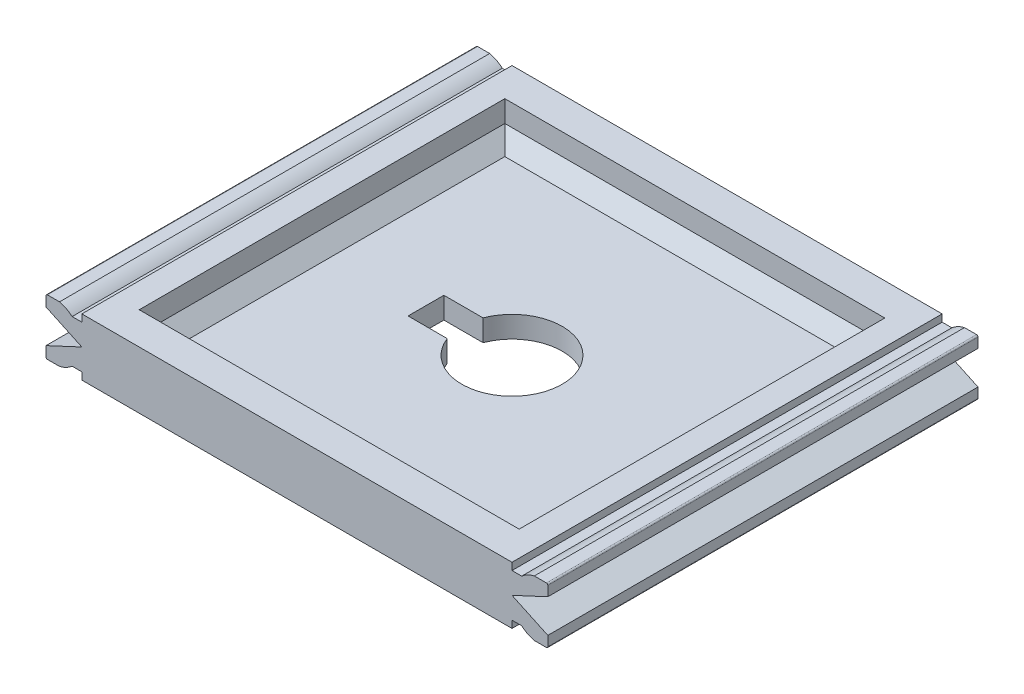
ISO-10303-21;
HEADER;
FILE_DESCRIPTION(('STEP AP214'),'2;1');
FILE_NAME('part.step','',(''),(''),'','','');
FILE_SCHEMA(('AUTOMOTIVE_DESIGN { 1 0 10303 214 1 1 1 1 }'));
ENDSEC;
DATA;
#1=APPLICATION_CONTEXT('core data for automotive mechanical design processes');
#2=APPLICATION_PROTOCOL_DEFINITION('international standard','automotive_design',2000,#1);
#3=PRODUCT_CONTEXT('',#1,'mechanical');
#4=PRODUCT('Part','Part','',(#3));
#5=PRODUCT_RELATED_PRODUCT_CATEGORY('part','',(#4));
#6=PRODUCT_DEFINITION_FORMATION('','',#4);
#7=PRODUCT_DEFINITION_CONTEXT('part definition',#1,'design');
#8=PRODUCT_DEFINITION('design','',#6,#7);
#9=PRODUCT_DEFINITION_SHAPE('','',#8);
#10=(LENGTH_UNIT() NAMED_UNIT(*) SI_UNIT(.MILLI.,.METRE.));
#11=(NAMED_UNIT(*) PLANE_ANGLE_UNIT() SI_UNIT($,.RADIAN.));
#12=(NAMED_UNIT(*) SI_UNIT($,.STERADIAN.) SOLID_ANGLE_UNIT());
#13=UNCERTAINTY_MEASURE_WITH_UNIT(LENGTH_MEASURE(1.E-05),#10,'distance_accuracy_value','');
#14=(GEOMETRIC_REPRESENTATION_CONTEXT(3) GLOBAL_UNCERTAINTY_ASSIGNED_CONTEXT((#13)) GLOBAL_UNIT_ASSIGNED_CONTEXT((#10,
#11,#12)) REPRESENTATION_CONTEXT('',''));
#15=CARTESIAN_POINT('',(0.,0.,0.));
#16=DIRECTION('',(0.,0.,1.));
#17=DIRECTION('',(1.,0.,0.));
#18=AXIS2_PLACEMENT_3D('',#15,#16,#17);
#19=CARTESIAN_POINT('',(-15.,-2.,-15.));
#20=DIRECTION('',(-1.,0.,0.));
#21=DIRECTION('',(0.,0.,1.));
#22=AXIS2_PLACEMENT_3D('',#19,#20,#21);
#23=PLANE('',#22);
#24=DIRECTION('',(0.,1.,0.));
#25=VECTOR('',#24,1.);
#26=CARTESIAN_POINT('',(-15.,-2.,15.));
#27=LINE('',#26,#25);
#28=CARTESIAN_POINT('',(-15.,-2.,15.));
#29=VERTEX_POINT('',#28);
#30=CARTESIAN_POINT('',(-15.,-1.5,15.));
#31=VERTEX_POINT('',#30);
#32=EDGE_CURVE('E570',#29,#31,#27,.T.);
#33=ORIENTED_EDGE('',*,*,#32,.T.);
#34=DIRECTION('',(0.,0.,1.));
#35=VECTOR('',#34,1.);
#36=CARTESIAN_POINT('',(-15.,-1.5,-15.));
#37=LINE('',#36,#35);
#38=CARTESIAN_POINT('',(-15.,-1.5,-15.));
#39=VERTEX_POINT('',#38);
#40=EDGE_CURVE('E355',#39,#31,#37,.T.);
#41=ORIENTED_EDGE('',*,*,#40,.F.);
#42=DIRECTION('',(0.,1.,0.));
#43=VECTOR('',#42,1.);
#44=CARTESIAN_POINT('',(-15.,-2.,-15.));
#45=LINE('',#44,#43);
#46=CARTESIAN_POINT('',(-15.,-2.,-15.));
#47=VERTEX_POINT('',#46);
#48=EDGE_CURVE('E589',#47,#39,#45,.T.);
#49=ORIENTED_EDGE('',*,*,#48,.F.);
#50=DIRECTION('',(0.,0.,1.));
#51=VECTOR('',#50,1.);
#52=CARTESIAN_POINT('',(-15.,-2.,-15.));
#53=LINE('',#52,#51);
#54=EDGE_CURVE('E601',#47,#29,#53,.T.);
#55=ORIENTED_EDGE('',*,*,#54,.T.);
#56=EDGE_LOOP('',(#33,#41,#49,#55));
#57=FACE_BOUND('',#56,.T.);
#58=ADVANCED_FACE('F36',(#57),#23,.T.);
#59=CARTESIAN_POINT('',(-15.,1.5,-15.));
#60=VERTEX_POINT('',#59);
#61=CARTESIAN_POINT('',(-15.,2.,-15.));
#62=VERTEX_POINT('',#61);
#63=EDGE_CURVE('E588',#60,#62,#45,.T.);
#64=ORIENTED_EDGE('',*,*,#63,.F.);
#65=DIRECTION('',(0.,0.,1.));
#66=VECTOR('',#65,1.);
#67=CARTESIAN_POINT('',(-15.,1.5,-15.));
#68=LINE('',#67,#66);
#69=CARTESIAN_POINT('',(-15.,1.5,15.));
#70=VERTEX_POINT('',#69);
#71=EDGE_CURVE('E386',#60,#70,#68,.T.);
#72=ORIENTED_EDGE('',*,*,#71,.T.);
#73=CARTESIAN_POINT('',(-15.,2.,15.));
#74=VERTEX_POINT('',#73);
#75=EDGE_CURVE('E575',#70,#74,#27,.T.);
#76=ORIENTED_EDGE('',*,*,#75,.T.);
#77=DIRECTION('',(0.,0.,1.));
#78=VECTOR('',#77,1.);
#79=CARTESIAN_POINT('',(-15.,2.,-15.));
#80=LINE('',#79,#78);
#81=EDGE_CURVE('E691',#62,#74,#80,.T.);
#82=ORIENTED_EDGE('',*,*,#81,.F.);
#83=EDGE_LOOP('',(#64,#72,#76,#82));
#84=FACE_BOUND('',#83,.T.);
#85=ADVANCED_FACE('F790',(#84),#23,.T.);
#86=CARTESIAN_POINT('',(15.,-2.,-15.));
#87=DIRECTION('',(1.,0.,0.));
#88=DIRECTION('',(0.,0.,-1.));
#89=AXIS2_PLACEMENT_3D('',#86,#87,#88);
#90=PLANE('',#89);
#91=DIRECTION('',(0.,0.,1.));
#92=VECTOR('',#91,1.);
#93=CARTESIAN_POINT('',(15.,-1.5,-15.));
#94=LINE('',#93,#92);
#95=CARTESIAN_POINT('',(15.,-1.5,-15.));
#96=VERTEX_POINT('',#95);
#97=CARTESIAN_POINT('',(15.,-1.5,15.));
#98=VERTEX_POINT('',#97);
#99=EDGE_CURVE('E517',#96,#98,#94,.T.);
#100=ORIENTED_EDGE('',*,*,#99,.T.);
#101=DIRECTION('',(0.,1.,0.));
#102=VECTOR('',#101,1.);
#103=CARTESIAN_POINT('',(15.,-2.,15.));
#104=LINE('',#103,#102);
#105=CARTESIAN_POINT('',(15.,-2.,15.));
#106=VERTEX_POINT('',#105);
#107=EDGE_CURVE('E716',#106,#98,#104,.T.);
#108=ORIENTED_EDGE('',*,*,#107,.F.);
#109=DIRECTION('',(0.,0.,-1.));
#110=VECTOR('',#109,1.);
#111=CARTESIAN_POINT('',(15.,-2.,-15.));
#112=LINE('',#111,#110);
#113=CARTESIAN_POINT('',(15.,-2.,-15.));
#114=VERTEX_POINT('',#113);
#115=EDGE_CURVE('E592',#106,#114,#112,.T.);
#116=ORIENTED_EDGE('',*,*,#115,.T.);
#117=DIRECTION('',(0.,1.,0.));
#118=VECTOR('',#117,1.);
#119=CARTESIAN_POINT('',(15.,-2.,-15.));
#120=LINE('',#119,#118);
#121=EDGE_CURVE('E610',#114,#96,#120,.T.);
#122=ORIENTED_EDGE('',*,*,#121,.T.);
#123=EDGE_LOOP('',(#100,#108,#116,#122));
#124=FACE_BOUND('',#123,.T.);
#125=ADVANCED_FACE('F709',(#124),#90,.T.);
#126=CARTESIAN_POINT('',(15.,-2.,-15.));
#127=DIRECTION('',(0.,0.,-1.));
#128=DIRECTION('',(-1.,0.,0.));
#129=AXIS2_PLACEMENT_3D('',#126,#127,#128);
#130=PLANE('',#129);
#131=DIRECTION('',(0.,-1.,0.));
#132=VECTOR('',#131,1.);
#133=CARTESIAN_POINT('',(17.5,0.,-15.));
#134=LINE('',#133,#132);
#135=CARTESIAN_POINT('',(17.5,-1.1657691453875,-15.));
#136=VERTEX_POINT('',#135);
#137=CARTESIAN_POINT('',(17.5,-1.85,-15.));
#138=VERTEX_POINT('',#137);
#139=EDGE_CURVE('E502',#136,#138,#134,.T.);
#140=ORIENTED_EDGE('',*,*,#139,.T.);
#141=CARTESIAN_POINT('',(17.4,-1.85,-15.));
#142=DIRECTION('',(0.,0.,-1.));
#143=DIRECTION('',(-1.,0.,0.));
#144=AXIS2_PLACEMENT_3D('',#141,#142,#143);
#145=CIRCLE('',#144,0.1);
#146=CARTESIAN_POINT('',(17.4,-1.95,-15.));
#147=VERTEX_POINT('',#146);
#148=EDGE_CURVE('E433',#138,#147,#145,.T.);
#149=ORIENTED_EDGE('',*,*,#148,.T.);
#150=DIRECTION('',(-1.,0.,0.));
#151=VECTOR('',#150,1.);
#152=CARTESIAN_POINT('',(0.,-1.94999999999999,-15.));
#153=LINE('',#152,#151);
#154=CARTESIAN_POINT('',(16.5555902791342,-1.95,-15.));
#155=VERTEX_POINT('',#154);
#156=EDGE_CURVE('E500',#147,#155,#153,.T.);
#157=ORIENTED_EDGE('',*,*,#156,.T.);
#158=CARTESIAN_POINT('',(17.,0.,-15.));
#159=DIRECTION('',(0.,0.,-1.));
#160=DIRECTION('',(1.,0.,0.));
#161=AXIS2_PLACEMENT_3D('',#158,#159,#160);
#162=CIRCLE('',#161,2.);
#163=CARTESIAN_POINT('',(15.6771243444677,-1.5,-15.));
#164=VERTEX_POINT('',#163);
#165=EDGE_CURVE('E508',#155,#164,#162,.T.);
#166=ORIENTED_EDGE('',*,*,#165,.T.);
#167=DIRECTION('',(1.,0.,0.));
#168=VECTOR('',#167,1.);
#169=CARTESIAN_POINT('',(0.,-1.50000000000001,-15.));
#170=LINE('',#169,#168);
#171=EDGE_CURVE('E505',#96,#164,#170,.T.);
#172=ORIENTED_EDGE('',*,*,#171,.F.);
#173=ORIENTED_EDGE('',*,*,#121,.F.);
#174=DIRECTION('',(-1.,0.,0.));
#175=VECTOR('',#174,1.);
#176=CARTESIAN_POINT('',(15.,-2.,-15.));
#177=LINE('',#176,#175);
#178=EDGE_CURVE('E700',#114,#47,#177,.T.);
#179=ORIENTED_EDGE('',*,*,#178,.T.);
#180=ORIENTED_EDGE('',*,*,#48,.T.);
#181=DIRECTION('',(-1.,0.,0.));
#182=VECTOR('',#181,1.);
#183=CARTESIAN_POINT('',(0.,-1.50000000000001,-15.));
#184=LINE('',#183,#182);
#185=CARTESIAN_POINT('',(-15.6771243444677,-1.5,-15.));
#186=VERTEX_POINT('',#185);
#187=EDGE_CURVE('E345',#39,#186,#184,.T.);
#188=ORIENTED_EDGE('',*,*,#187,.T.);
#189=CARTESIAN_POINT('',(-17.,0.,-15.));
#190=DIRECTION('',(0.,0.,1.));
#191=DIRECTION('',(-1.,0.,0.));
#192=AXIS2_PLACEMENT_3D('',#189,#190,#191);
#193=CIRCLE('',#192,2.);
#194=CARTESIAN_POINT('',(-16.5555902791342,-1.95,-15.));
#195=VERTEX_POINT('',#194);
#196=EDGE_CURVE('E342',#195,#186,#193,.T.);
#197=ORIENTED_EDGE('',*,*,#196,.F.);
#198=DIRECTION('',(1.,0.,0.));
#199=VECTOR('',#198,1.);
#200=CARTESIAN_POINT('',(0.,-1.94999999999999,-15.));
#201=LINE('',#200,#199);
#202=CARTESIAN_POINT('',(-17.4,-1.95,-15.));
#203=VERTEX_POINT('',#202);
#204=EDGE_CURVE('E340',#203,#195,#201,.T.);
#205=ORIENTED_EDGE('',*,*,#204,.F.);
#206=CARTESIAN_POINT('',(-17.4,-1.85,-15.));
#207=DIRECTION('',(0.,0.,-1.));
#208=DIRECTION('',(-1.,0.,0.));
#209=AXIS2_PLACEMENT_3D('',#206,#207,#208);
#210=CIRCLE('',#209,0.1);
#211=CARTESIAN_POINT('',(-17.5,-1.85,-15.));
#212=VERTEX_POINT('',#211);
#213=EDGE_CURVE('E429',#203,#212,#210,.T.);
#214=ORIENTED_EDGE('',*,*,#213,.T.);
#215=DIRECTION('',(0.,-1.,0.));
#216=VECTOR('',#215,1.);
#217=CARTESIAN_POINT('',(-17.5,0.,-15.));
#218=LINE('',#217,#216);
#219=CARTESIAN_POINT('',(-17.5,-1.1657691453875,-15.));
#220=VERTEX_POINT('',#219);
#221=EDGE_CURVE('E348',#220,#212,#218,.T.);
#222=ORIENTED_EDGE('',*,*,#221,.F.);
#223=DIRECTION('',(-0.906307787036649,-0.422618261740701,0.));
#224=VECTOR('',#223,1.);
#225=CARTESIAN_POINT('',(-2.67909292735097,5.74533332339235,-15.));
#226=LINE('',#225,#224);
#227=CARTESIAN_POINT('',(-15.,0.,-15.));
#228=VERTEX_POINT('',#227);
#229=EDGE_CURVE('E347',#228,#220,#226,.T.);
#230=ORIENTED_EDGE('',*,*,#229,.F.);
#231=DIRECTION('',(-0.906307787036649,0.422618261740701,0.));
#232=VECTOR('',#231,1.);
#233=CARTESIAN_POINT('',(-2.67909292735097,-5.74533332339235,-15.));
#234=LINE('',#233,#232);
#235=CARTESIAN_POINT('',(-17.5,1.1657691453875,-15.));
#236=VERTEX_POINT('',#235);
#237=EDGE_CURVE('E375',#228,#236,#234,.T.);
#238=ORIENTED_EDGE('',*,*,#237,.T.);
#239=DIRECTION('',(0.,1.,0.));
#240=VECTOR('',#239,1.);
#241=CARTESIAN_POINT('',(-17.5,0.,-15.));
#242=LINE('',#241,#240);
#243=CARTESIAN_POINT('',(-17.5,1.85,-15.));
#244=VERTEX_POINT('',#243);
#245=EDGE_CURVE('E372',#236,#244,#242,.T.);
#246=ORIENTED_EDGE('',*,*,#245,.T.);
#247=CARTESIAN_POINT('',(-17.4,1.85,-15.));
#248=DIRECTION('',(0.,0.,-1.));
#249=DIRECTION('',(-1.,0.,0.));
#250=AXIS2_PLACEMENT_3D('',#247,#248,#249);
#251=CIRCLE('',#250,0.1);
#252=CARTESIAN_POINT('',(-17.4,1.95,-15.));
#253=VERTEX_POINT('',#252);
#254=EDGE_CURVE('E427',#244,#253,#251,.T.);
#255=ORIENTED_EDGE('',*,*,#254,.T.);
#256=DIRECTION('',(1.,0.,0.));
#257=VECTOR('',#256,1.);
#258=CARTESIAN_POINT('',(0.,1.94999999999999,-15.));
#259=LINE('',#258,#257);
#260=CARTESIAN_POINT('',(-16.5555902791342,1.95,-15.));
#261=VERTEX_POINT('',#260);
#262=EDGE_CURVE('E369',#253,#261,#259,.T.);
#263=ORIENTED_EDGE('',*,*,#262,.T.);
#264=CARTESIAN_POINT('',(-17.,0.,-15.));
#265=DIRECTION('',(0.,0.,-1.));
#266=DIRECTION('',(-1.,0.,0.));
#267=AXIS2_PLACEMENT_3D('',#264,#265,#266);
#268=CIRCLE('',#267,2.);
#269=CARTESIAN_POINT('',(-15.6771243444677,1.5,-15.));
#270=VERTEX_POINT('',#269);
#271=EDGE_CURVE('E376',#261,#270,#268,.T.);
#272=ORIENTED_EDGE('',*,*,#271,.T.);
#273=DIRECTION('',(-1.,0.,0.));
#274=VECTOR('',#273,1.);
#275=CARTESIAN_POINT('',(0.,1.50000000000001,-15.));
#276=LINE('',#275,#274);
#277=EDGE_CURVE('E379',#60,#270,#276,.T.);
#278=ORIENTED_EDGE('',*,*,#277,.F.);
#279=ORIENTED_EDGE('',*,*,#63,.T.);
#280=DIRECTION('',(-1.,0.,0.));
#281=VECTOR('',#280,1.);
#282=CARTESIAN_POINT('',(15.,2.,-15.));
#283=LINE('',#282,#281);
#284=CARTESIAN_POINT('',(15.,2.,-15.));
#285=VERTEX_POINT('',#284);
#286=EDGE_CURVE('E665',#285,#62,#283,.T.);
#287=ORIENTED_EDGE('',*,*,#286,.F.);
#288=CARTESIAN_POINT('',(15.,1.5,-15.));
#289=VERTEX_POINT('',#288);
#290=EDGE_CURVE('E607',#289,#285,#120,.T.);
#291=ORIENTED_EDGE('',*,*,#290,.F.);
#292=DIRECTION('',(1.,0.,0.));
#293=VECTOR('',#292,1.);
#294=CARTESIAN_POINT('',(0.,1.50000000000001,-15.));
#295=LINE('',#294,#293);
#296=CARTESIAN_POINT('',(15.6771243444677,1.5,-15.));
#297=VERTEX_POINT('',#296);
#298=EDGE_CURVE('E534',#289,#297,#295,.T.);
#299=ORIENTED_EDGE('',*,*,#298,.T.);
#300=CARTESIAN_POINT('',(17.,0.,-15.));
#301=DIRECTION('',(0.,0.,1.));
#302=DIRECTION('',(1.,0.,0.));
#303=AXIS2_PLACEMENT_3D('',#300,#301,#302);
#304=CIRCLE('',#303,2.);
#305=CARTESIAN_POINT('',(16.5555902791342,1.95,-15.));
#306=VERTEX_POINT('',#305);
#307=EDGE_CURVE('E531',#306,#297,#304,.T.);
#308=ORIENTED_EDGE('',*,*,#307,.F.);
#309=DIRECTION('',(-1.,0.,0.));
#310=VECTOR('',#309,1.);
#311=CARTESIAN_POINT('',(0.,1.94999999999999,-15.));
#312=LINE('',#311,#310);
#313=CARTESIAN_POINT('',(17.4,1.95,-15.));
#314=VERTEX_POINT('',#313);
#315=EDGE_CURVE('E528',#314,#306,#312,.T.);
#316=ORIENTED_EDGE('',*,*,#315,.F.);
#317=CARTESIAN_POINT('',(17.4,1.85,-15.));
#318=DIRECTION('',(0.,0.,-1.));
#319=DIRECTION('',(-1.,0.,0.));
#320=AXIS2_PLACEMENT_3D('',#317,#318,#319);
#321=CIRCLE('',#320,0.1);
#322=CARTESIAN_POINT('',(17.5,1.85,-15.));
#323=VERTEX_POINT('',#322);
#324=EDGE_CURVE('E431',#314,#323,#321,.T.);
#325=ORIENTED_EDGE('',*,*,#324,.T.);
#326=DIRECTION('',(0.,1.,0.));
#327=VECTOR('',#326,1.);
#328=CARTESIAN_POINT('',(17.5,0.,-15.));
#329=LINE('',#328,#327);
#330=CARTESIAN_POINT('',(17.5,1.1657691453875,-15.));
#331=VERTEX_POINT('',#330);
#332=EDGE_CURVE('E535',#331,#323,#329,.T.);
#333=ORIENTED_EDGE('',*,*,#332,.F.);
#334=DIRECTION('',(0.906307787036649,0.422618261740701,0.));
#335=VECTOR('',#334,1.);
#336=CARTESIAN_POINT('',(2.67909292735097,-5.74533332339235,-15.));
#337=LINE('',#336,#335);
#338=CARTESIAN_POINT('',(15.,0.,-15.));
#339=VERTEX_POINT('',#338);
#340=EDGE_CURVE('E539',#339,#331,#337,.T.);
#341=ORIENTED_EDGE('',*,*,#340,.F.);
#342=DIRECTION('',(0.906307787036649,-0.422618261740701,0.));
#343=VECTOR('',#342,1.);
#344=CARTESIAN_POINT('',(2.67909292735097,5.74533332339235,-15.));
#345=LINE('',#344,#343);
#346=EDGE_CURVE('E504',#339,#136,#345,.T.);
#347=ORIENTED_EDGE('',*,*,#346,.T.);
#348=EDGE_LOOP('',(#140,#149,#157,#166,#172,#173,#179,#180,#188,#197,#205,#214,#222,#230,#238,
#246,#255,#263,#272,#278,#279,#287,#291,#299,#308,#316,#325,#333,#341,#347));
#349=FACE_BOUND('',#348,.T.);
#350=ADVANCED_FACE('F467',(#349),#130,.T.);
#351=DIRECTION('',(0.,0.,1.));
#352=VECTOR('',#351,1.);
#353=CARTESIAN_POINT('',(15.,1.5,-15.));
#354=LINE('',#353,#352);
#355=CARTESIAN_POINT('',(15.,1.5,15.));
#356=VERTEX_POINT('',#355);
#357=EDGE_CURVE('E552',#289,#356,#354,.T.);
#358=ORIENTED_EDGE('',*,*,#357,.F.);
#359=ORIENTED_EDGE('',*,*,#290,.T.);
#360=DIRECTION('',(0.,0.,-1.));
#361=VECTOR('',#360,1.);
#362=CARTESIAN_POINT('',(15.,2.,-15.));
#363=LINE('',#362,#361);
#364=CARTESIAN_POINT('',(15.,2.,15.));
#365=VERTEX_POINT('',#364);
#366=EDGE_CURVE('E697',#365,#285,#363,.T.);
#367=ORIENTED_EDGE('',*,*,#366,.F.);
#368=EDGE_CURVE('E574',#356,#365,#104,.T.);
#369=ORIENTED_EDGE('',*,*,#368,.F.);
#370=EDGE_LOOP('',(#358,#359,#367,#369));
#371=FACE_BOUND('',#370,.T.);
#372=ADVANCED_FACE('F779',(#371),#90,.T.);
#373=CARTESIAN_POINT('',(15.,-2.,15.));
#374=DIRECTION('',(0.,0.,1.));
#375=DIRECTION('',(1.,0.,0.));
#376=AXIS2_PLACEMENT_3D('',#373,#374,#375);
#377=PLANE('',#376);
#378=DIRECTION('',(-1.,0.,0.));
#379=VECTOR('',#378,1.);
#380=CARTESIAN_POINT('',(0.,-1.94999999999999,15.));
#381=LINE('',#380,#379);
#382=CARTESIAN_POINT('',(17.4,-1.95,15.));
#383=VERTEX_POINT('',#382);
#384=CARTESIAN_POINT('',(16.5555902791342,-1.95,15.));
#385=VERTEX_POINT('',#384);
#386=EDGE_CURVE('E383',#383,#385,#381,.T.);
#387=ORIENTED_EDGE('',*,*,#386,.F.);
#388=CARTESIAN_POINT('',(17.4,-1.85,15.));
#389=DIRECTION('',(0.,0.,1.));
#390=DIRECTION('',(1.,0.,0.));
#391=AXIS2_PLACEMENT_3D('',#388,#389,#390);
#392=CIRCLE('',#391,0.1);
#393=CARTESIAN_POINT('',(17.5,-1.85,15.));
#394=VERTEX_POINT('',#393);
#395=EDGE_CURVE('E423',#383,#394,#392,.T.);
#396=ORIENTED_EDGE('',*,*,#395,.T.);
#397=DIRECTION('',(0.,-1.,0.));
#398=VECTOR('',#397,1.);
#399=CARTESIAN_POINT('',(17.5,0.,15.));
#400=LINE('',#399,#398);
#401=CARTESIAN_POINT('',(17.5,-1.1657691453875,15.));
#402=VERTEX_POINT('',#401);
#403=EDGE_CURVE('E490',#402,#394,#400,.T.);
#404=ORIENTED_EDGE('',*,*,#403,.F.);
#405=DIRECTION('',(0.906307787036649,-0.422618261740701,0.));
#406=VECTOR('',#405,1.);
#407=CARTESIAN_POINT('',(2.67909292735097,5.74533332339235,15.));
#408=LINE('',#407,#406);
#409=CARTESIAN_POINT('',(15.,0.,15.));
#410=VERTEX_POINT('',#409);
#411=EDGE_CURVE('E493',#410,#402,#408,.T.);
#412=ORIENTED_EDGE('',*,*,#411,.F.);
#413=DIRECTION('',(0.906307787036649,0.422618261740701,0.));
#414=VECTOR('',#413,1.);
#415=CARTESIAN_POINT('',(2.67909292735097,-5.74533332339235,15.));
#416=LINE('',#415,#414);
#417=CARTESIAN_POINT('',(17.5,1.1657691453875,15.));
#418=VERTEX_POINT('',#417);
#419=EDGE_CURVE('E529',#410,#418,#416,.T.);
#420=ORIENTED_EDGE('',*,*,#419,.T.);
#421=DIRECTION('',(0.,1.,0.));
#422=VECTOR('',#421,1.);
#423=CARTESIAN_POINT('',(17.5,0.,15.));
#424=LINE('',#423,#422);
#425=CARTESIAN_POINT('',(17.5,1.85,15.));
#426=VERTEX_POINT('',#425);
#427=EDGE_CURVE('E525',#418,#426,#424,.T.);
#428=ORIENTED_EDGE('',*,*,#427,.T.);
#429=CARTESIAN_POINT('',(17.4,1.85,15.));
#430=DIRECTION('',(0.,0.,1.));
#431=DIRECTION('',(1.,0.,0.));
#432=AXIS2_PLACEMENT_3D('',#429,#430,#431);
#433=CIRCLE('',#432,0.1);
#434=CARTESIAN_POINT('',(17.4,1.95,15.));
#435=VERTEX_POINT('',#434);
#436=EDGE_CURVE('E421',#426,#435,#433,.T.);
#437=ORIENTED_EDGE('',*,*,#436,.T.);
#438=DIRECTION('',(-1.,0.,0.));
#439=VECTOR('',#438,1.);
#440=CARTESIAN_POINT('',(0.,1.94999999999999,15.));
#441=LINE('',#440,#439);
#442=CARTESIAN_POINT('',(16.5555902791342,1.95,15.));
#443=VERTEX_POINT('',#442);
#444=EDGE_CURVE('E514',#435,#443,#441,.T.);
#445=ORIENTED_EDGE('',*,*,#444,.T.);
#446=CARTESIAN_POINT('',(17.,0.,15.));
#447=DIRECTION('',(0.,0.,1.));
#448=DIRECTION('',(1.,0.,0.));
#449=AXIS2_PLACEMENT_3D('',#446,#447,#448);
#450=CIRCLE('',#449,2.);
#451=CARTESIAN_POINT('',(15.6771243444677,1.5,15.));
#452=VERTEX_POINT('',#451);
#453=EDGE_CURVE('E521',#443,#452,#450,.T.);
#454=ORIENTED_EDGE('',*,*,#453,.T.);
#455=DIRECTION('',(1.,0.,0.));
#456=VECTOR('',#455,1.);
#457=CARTESIAN_POINT('',(0.,1.50000000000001,15.));
#458=LINE('',#457,#456);
#459=EDGE_CURVE('E524',#356,#452,#458,.T.);
#460=ORIENTED_EDGE('',*,*,#459,.F.);
#461=ORIENTED_EDGE('',*,*,#368,.T.);
#462=DIRECTION('',(1.,0.,0.));
#463=VECTOR('',#462,1.);
#464=CARTESIAN_POINT('',(15.,2.,15.));
#465=LINE('',#464,#463);
#466=EDGE_CURVE('E694',#74,#365,#465,.T.);
#467=ORIENTED_EDGE('',*,*,#466,.F.);
#468=ORIENTED_EDGE('',*,*,#75,.F.);
#469=DIRECTION('',(-1.,0.,0.));
#470=VECTOR('',#469,1.);
#471=CARTESIAN_POINT('',(0.,1.50000000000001,15.));
#472=LINE('',#471,#470);
#473=CARTESIAN_POINT('',(-15.6771243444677,1.5,15.));
#474=VERTEX_POINT('',#473);
#475=EDGE_CURVE('E370',#70,#474,#472,.T.);
#476=ORIENTED_EDGE('',*,*,#475,.T.);
#477=CARTESIAN_POINT('',(-17.,0.,15.));
#478=DIRECTION('',(0.,0.,-1.));
#479=DIRECTION('',(-1.,0.,0.));
#480=AXIS2_PLACEMENT_3D('',#477,#478,#479);
#481=CIRCLE('',#480,2.);
#482=CARTESIAN_POINT('',(-16.5555902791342,1.95,15.));
#483=VERTEX_POINT('',#482);
#484=EDGE_CURVE('E366',#483,#474,#481,.T.);
#485=ORIENTED_EDGE('',*,*,#484,.F.);
#486=DIRECTION('',(1.,0.,0.));
#487=VECTOR('',#486,1.);
#488=CARTESIAN_POINT('',(0.,1.94999999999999,15.));
#489=LINE('',#488,#487);
#490=CARTESIAN_POINT('',(-17.4,1.95,15.));
#491=VERTEX_POINT('',#490);
#492=EDGE_CURVE('E354',#491,#483,#489,.T.);
#493=ORIENTED_EDGE('',*,*,#492,.F.);
#494=CARTESIAN_POINT('',(-17.4,1.85,15.));
#495=DIRECTION('',(0.,0.,1.));
#496=DIRECTION('',(1.,0.,0.));
#497=AXIS2_PLACEMENT_3D('',#494,#495,#496);
#498=CIRCLE('',#497,0.1);
#499=CARTESIAN_POINT('',(-17.5,1.85,15.));
#500=VERTEX_POINT('',#499);
#501=EDGE_CURVE('E416',#491,#500,#498,.T.);
#502=ORIENTED_EDGE('',*,*,#501,.T.);
#503=DIRECTION('',(0.,1.,0.));
#504=VECTOR('',#503,1.);
#505=CARTESIAN_POINT('',(-17.5,0.,15.));
#506=LINE('',#505,#504);
#507=CARTESIAN_POINT('',(-17.5,1.1657691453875,15.));
#508=VERTEX_POINT('',#507);
#509=EDGE_CURVE('E362',#508,#500,#506,.T.);
#510=ORIENTED_EDGE('',*,*,#509,.F.);
#511=DIRECTION('',(-0.906307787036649,0.422618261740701,0.));
#512=VECTOR('',#511,1.);
#513=CARTESIAN_POINT('',(-2.67909292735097,-5.74533332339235,15.));
#514=LINE('',#513,#512);
#515=CARTESIAN_POINT('',(-15.,0.,15.));
#516=VERTEX_POINT('',#515);
#517=EDGE_CURVE('E365',#516,#508,#514,.T.);
#518=ORIENTED_EDGE('',*,*,#517,.F.);
#519=DIRECTION('',(-0.906307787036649,-0.422618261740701,0.));
#520=VECTOR('',#519,1.);
#521=CARTESIAN_POINT('',(-2.67909292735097,5.74533332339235,15.));
#522=LINE('',#521,#520);
#523=CARTESIAN_POINT('',(-17.5,-1.1657691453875,15.));
#524=VERTEX_POINT('',#523);
#525=EDGE_CURVE('E336',#516,#524,#522,.T.);
#526=ORIENTED_EDGE('',*,*,#525,.T.);
#527=DIRECTION('',(0.,-1.,0.));
#528=VECTOR('',#527,1.);
#529=CARTESIAN_POINT('',(-17.5,0.,15.));
#530=LINE('',#529,#528);
#531=CARTESIAN_POINT('',(-17.5,-1.85,15.));
#532=VERTEX_POINT('',#531);
#533=EDGE_CURVE('E337',#524,#532,#530,.T.);
#534=ORIENTED_EDGE('',*,*,#533,.T.);
#535=CARTESIAN_POINT('',(-17.4,-1.85,15.));
#536=DIRECTION('',(0.,0.,1.));
#537=DIRECTION('',(1.,0.,0.));
#538=AXIS2_PLACEMENT_3D('',#535,#536,#537);
#539=CIRCLE('',#538,0.1);
#540=CARTESIAN_POINT('',(-17.4,-1.95,15.));
#541=VERTEX_POINT('',#540);
#542=EDGE_CURVE('E419',#532,#541,#539,.T.);
#543=ORIENTED_EDGE('',*,*,#542,.T.);
#544=DIRECTION('',(1.,0.,0.));
#545=VECTOR('',#544,1.);
#546=CARTESIAN_POINT('',(0.,-1.94999999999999,15.));
#547=LINE('',#546,#545);
#548=CARTESIAN_POINT('',(-16.5555902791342,-1.95,15.));
#549=VERTEX_POINT('',#548);
#550=EDGE_CURVE('E306',#541,#549,#547,.T.);
#551=ORIENTED_EDGE('',*,*,#550,.T.);
#552=CARTESIAN_POINT('',(-17.,0.,15.));
#553=DIRECTION('',(0.,0.,1.));
#554=DIRECTION('',(-1.,0.,0.));
#555=AXIS2_PLACEMENT_3D('',#552,#553,#554);
#556=CIRCLE('',#555,2.);
#557=CARTESIAN_POINT('',(-15.6771243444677,-1.5,15.));
#558=VERTEX_POINT('',#557);
#559=EDGE_CURVE('E330',#549,#558,#556,.T.);
#560=ORIENTED_EDGE('',*,*,#559,.T.);
#561=DIRECTION('',(-1.,0.,0.));
#562=VECTOR('',#561,1.);
#563=CARTESIAN_POINT('',(0.,-1.50000000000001,15.));
#564=LINE('',#563,#562);
#565=EDGE_CURVE('E333',#31,#558,#564,.T.);
#566=ORIENTED_EDGE('',*,*,#565,.F.);
#567=ORIENTED_EDGE('',*,*,#32,.F.);
#568=DIRECTION('',(1.,0.,0.));
#569=VECTOR('',#568,1.);
#570=CARTESIAN_POINT('',(15.,-2.,15.));
#571=LINE('',#570,#569);
#572=EDGE_CURVE('E596',#29,#106,#571,.T.);
#573=ORIENTED_EDGE('',*,*,#572,.T.);
#574=ORIENTED_EDGE('',*,*,#107,.T.);
#575=DIRECTION('',(1.,0.,0.));
#576=VECTOR('',#575,1.);
#577=CARTESIAN_POINT('',(0.,-1.50000000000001,15.));
#578=LINE('',#577,#576);
#579=CARTESIAN_POINT('',(15.6771243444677,-1.5,15.));
#580=VERTEX_POINT('',#579);
#581=EDGE_CURVE('E494',#98,#580,#578,.T.);
#582=ORIENTED_EDGE('',*,*,#581,.T.);
#583=CARTESIAN_POINT('',(17.,0.,15.));
#584=DIRECTION('',(0.,0.,-1.));
#585=DIRECTION('',(1.,0.,0.));
#586=AXIS2_PLACEMENT_3D('',#583,#584,#585);
#587=CIRCLE('',#586,2.);
#588=EDGE_CURVE('E497',#385,#580,#587,.T.);
#589=ORIENTED_EDGE('',*,*,#588,.F.);
#590=EDGE_LOOP('',(#387,#396,#404,#412,#420,#428,#437,#445,#454,#460,#461,#467,#468,#476,#485,
#493,#502,#510,#518,#526,#534,#543,#551,#560,#566,#567,#573,#574,#582,#589));
#591=FACE_BOUND('',#590,.T.);
#592=ADVANCED_FACE('F456',(#591),#377,.T.);
#593=CARTESIAN_POINT('',(0.,-2.,0.));
#594=DIRECTION('',(0.,1.,0.));
#595=DIRECTION('',(0.,0.,1.));
#596=AXIS2_PLACEMENT_3D('',#593,#594,#595);
#597=PLANE('',#596);
#598=DIRECTION('',(1.,0.,0.));
#599=VECTOR('',#598,1.);
#600=CARTESIAN_POINT('',(-3.26917420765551,-2.,-1.25));
#601=LINE('',#600,#599);
#602=CARTESIAN_POINT('',(-6.,-2.,-1.25));
#603=VERTEX_POINT('',#602);
#604=CARTESIAN_POINT('',(-3.26917420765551,-2.,-1.25));
#605=VERTEX_POINT('',#604);
#606=EDGE_CURVE('E312',#603,#605,#601,.T.);
#607=ORIENTED_EDGE('',*,*,#606,.F.);
#608=DIRECTION('',(0.,0.,-1.));
#609=VECTOR('',#608,1.);
#610=CARTESIAN_POINT('',(-6.,-2.,-1.25));
#611=LINE('',#610,#609);
#612=CARTESIAN_POINT('',(-6.,-2.,1.25));
#613=VERTEX_POINT('',#612);
#614=EDGE_CURVE('E294',#613,#603,#611,.T.);
#615=ORIENTED_EDGE('',*,*,#614,.F.);
#616=DIRECTION('',(-1.,0.,0.));
#617=VECTOR('',#616,1.);
#618=CARTESIAN_POINT('',(-3.26917420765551,-2.,1.25));
#619=LINE('',#618,#617);
#620=CARTESIAN_POINT('',(-3.2691742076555,-2.,1.25));
#621=VERTEX_POINT('',#620);
#622=EDGE_CURVE('E303',#621,#613,#619,.T.);
#623=ORIENTED_EDGE('',*,*,#622,.F.);
#624=CARTESIAN_POINT('',(0.,-2.,0.));
#625=DIRECTION('',(0.,1.,0.));
#626=DIRECTION('',(0.,0.,1.));
#627=AXIS2_PLACEMENT_3D('',#624,#625,#626);
#628=CIRCLE('',#627,3.5);
#629=EDGE_CURVE('E51',#605,#621,#628,.F.);
#630=ORIENTED_EDGE('',*,*,#629,.F.);
#631=EDGE_LOOP('',(#607,#615,#623,#630));
#632=FACE_BOUND('',#631,.T.);
#633=ORIENTED_EDGE('',*,*,#178,.F.);
#634=ORIENTED_EDGE('',*,*,#115,.F.);
#635=ORIENTED_EDGE('',*,*,#572,.F.);
#636=ORIENTED_EDGE('',*,*,#54,.F.);
#637=EDGE_LOOP('',(#633,#634,#635,#636));
#638=FACE_BOUND('',#637,.T.);
#639=ADVANCED_FACE('F309',(#632,#638),#597,.F.);
#640=CARTESIAN_POINT('',(0.,2.,0.));
#641=DIRECTION('',(0.,1.,0.));
#642=DIRECTION('',(0.,0.,1.));
#643=AXIS2_PLACEMENT_3D('',#640,#641,#642);
#644=PLANE('',#643);
#645=DIRECTION('',(-1.,0.,0.));
#646=VECTOR('',#645,1.);
#647=CARTESIAN_POINT('',(13.25,2.,-12.75));
#648=LINE('',#647,#646);
#649=CARTESIAN_POINT('',(13.25,2.,-12.75));
#650=VERTEX_POINT('',#649);
#651=CARTESIAN_POINT('',(-13.25,2.,-12.75));
#652=VERTEX_POINT('',#651);
#653=EDGE_CURVE('E615',#650,#652,#648,.T.);
#654=ORIENTED_EDGE('',*,*,#653,.F.);
#655=DIRECTION('',(0.,0.,-1.));
#656=VECTOR('',#655,1.);
#657=CARTESIAN_POINT('',(13.25,2.,-12.75));
#658=LINE('',#657,#656);
#659=CARTESIAN_POINT('',(13.25,2.,12.75));
#660=VERTEX_POINT('',#659);
#661=EDGE_CURVE('E663',#660,#650,#658,.T.);
#662=ORIENTED_EDGE('',*,*,#661,.F.);
#663=DIRECTION('',(1.,0.,0.));
#664=VECTOR('',#663,1.);
#665=CARTESIAN_POINT('',(13.25,2.,12.75));
#666=LINE('',#665,#664);
#667=CARTESIAN_POINT('',(-13.25,2.,12.75));
#668=VERTEX_POINT('',#667);
#669=EDGE_CURVE('E1194',#668,#660,#666,.T.);
#670=ORIENTED_EDGE('',*,*,#669,.F.);
#671=DIRECTION('',(0.,0.,1.));
#672=VECTOR('',#671,1.);
#673=CARTESIAN_POINT('',(-13.25,2.,-12.75));
#674=LINE('',#673,#672);
#675=EDGE_CURVE('E683',#652,#668,#674,.T.);
#676=ORIENTED_EDGE('',*,*,#675,.F.);
#677=EDGE_LOOP('',(#654,#662,#670,#676));
#678=FACE_BOUND('',#677,.T.);
#679=ORIENTED_EDGE('',*,*,#286,.T.);
#680=ORIENTED_EDGE('',*,*,#81,.T.);
#681=ORIENTED_EDGE('',*,*,#466,.T.);
#682=ORIENTED_EDGE('',*,*,#366,.T.);
#683=EDGE_LOOP('',(#679,#680,#681,#682));
#684=FACE_BOUND('',#683,.T.);
#685=ADVANCED_FACE('F778',(#678,#684),#644,.T.);
#686=CARTESIAN_POINT('',(13.25,-0.5,-12.75));
#687=DIRECTION('',(0.,0.,-1.));
#688=DIRECTION('',(-1.,0.,0.));
#689=AXIS2_PLACEMENT_3D('',#686,#687,#688);
#690=PLANE('',#689);
#691=DIRECTION('',(0.,1.,0.));
#692=VECTOR('',#691,1.);
#693=CARTESIAN_POINT('',(-13.25,-0.5,-12.75));
#694=LINE('',#693,#692);
#695=CARTESIAN_POINT('',(-13.25,0.500000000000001,-12.75));
#696=VERTEX_POINT('',#695);
#697=EDGE_CURVE('E657',#696,#652,#694,.T.);
#698=ORIENTED_EDGE('',*,*,#697,.F.);
#699=DIRECTION('',(1.,0.,0.));
#700=VECTOR('',#699,1.);
#701=CARTESIAN_POINT('',(13.25,0.500000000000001,-12.75));
#702=LINE('',#701,#700);
#703=CARTESIAN_POINT('',(13.25,0.500000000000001,-12.75));
#704=VERTEX_POINT('',#703);
#705=EDGE_CURVE('E417',#696,#704,#702,.T.);
#706=ORIENTED_EDGE('',*,*,#705,.T.);
#707=DIRECTION('',(0.,1.,0.));
#708=VECTOR('',#707,1.);
#709=CARTESIAN_POINT('',(13.25,-0.5,-12.75));
#710=LINE('',#709,#708);
#711=EDGE_CURVE('E655',#704,#650,#710,.T.);
#712=ORIENTED_EDGE('',*,*,#711,.T.);
#713=ORIENTED_EDGE('',*,*,#653,.T.);
#714=EDGE_LOOP('',(#698,#706,#712,#713));
#715=FACE_BOUND('',#714,.T.);
#716=ADVANCED_FACE('F653',(#715),#690,.F.);
#717=CARTESIAN_POINT('',(13.25,-0.5,-12.75));
#718=DIRECTION('',(1.,0.,0.));
#719=DIRECTION('',(0.,0.,-1.));
#720=AXIS2_PLACEMENT_3D('',#717,#718,#719);
#721=PLANE('',#720);
#722=ORIENTED_EDGE('',*,*,#711,.F.);
#723=DIRECTION('',(0.,0.,1.));
#724=VECTOR('',#723,1.);
#725=CARTESIAN_POINT('',(13.25,0.500000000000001,-12.75));
#726=LINE('',#725,#724);
#727=CARTESIAN_POINT('',(13.25,0.500000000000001,12.75));
#728=VERTEX_POINT('',#727);
#729=EDGE_CURVE('E627',#704,#728,#726,.T.);
#730=ORIENTED_EDGE('',*,*,#729,.T.);
#731=DIRECTION('',(0.,1.,0.));
#732=VECTOR('',#731,1.);
#733=CARTESIAN_POINT('',(13.25,-0.5,12.75));
#734=LINE('',#733,#732);
#735=EDGE_CURVE('E666',#728,#660,#734,.T.);
#736=ORIENTED_EDGE('',*,*,#735,.T.);
#737=ORIENTED_EDGE('',*,*,#661,.T.);
#738=EDGE_LOOP('',(#722,#730,#736,#737));
#739=FACE_BOUND('',#738,.T.);
#740=ADVANCED_FACE('F660',(#739),#721,.F.);
#741=CARTESIAN_POINT('',(13.25,-0.5,12.75));
#742=DIRECTION('',(0.,0.,1.));
#743=DIRECTION('',(1.,0.,0.));
#744=AXIS2_PLACEMENT_3D('',#741,#742,#743);
#745=PLANE('',#744);
#746=ORIENTED_EDGE('',*,*,#735,.F.);
#747=DIRECTION('',(-1.,0.,0.));
#748=VECTOR('',#747,1.);
#749=CARTESIAN_POINT('',(13.25,0.500000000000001,12.75));
#750=LINE('',#749,#748);
#751=CARTESIAN_POINT('',(-13.25,0.500000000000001,12.75));
#752=VERTEX_POINT('',#751);
#753=EDGE_CURVE('E625',#728,#752,#750,.T.);
#754=ORIENTED_EDGE('',*,*,#753,.T.);
#755=DIRECTION('',(0.,1.,0.));
#756=VECTOR('',#755,1.);
#757=CARTESIAN_POINT('',(-13.25,-0.5,12.75));
#758=LINE('',#757,#756);
#759=EDGE_CURVE('E678',#752,#668,#758,.T.);
#760=ORIENTED_EDGE('',*,*,#759,.T.);
#761=ORIENTED_EDGE('',*,*,#669,.T.);
#762=EDGE_LOOP('',(#746,#754,#760,#761));
#763=FACE_BOUND('',#762,.T.);
#764=ADVANCED_FACE('F676',(#763),#745,.F.);
#765=CARTESIAN_POINT('',(-13.25,-0.5,-12.75));
#766=DIRECTION('',(-1.,0.,0.));
#767=DIRECTION('',(0.,0.,1.));
#768=AXIS2_PLACEMENT_3D('',#765,#766,#767);
#769=PLANE('',#768);
#770=ORIENTED_EDGE('',*,*,#759,.F.);
#771=DIRECTION('',(0.,0.,-1.));
#772=VECTOR('',#771,1.);
#773=CARTESIAN_POINT('',(-13.25,0.500000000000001,-12.75));
#774=LINE('',#773,#772);
#775=EDGE_CURVE('E623',#752,#696,#774,.T.);
#776=ORIENTED_EDGE('',*,*,#775,.T.);
#777=ORIENTED_EDGE('',*,*,#697,.T.);
#778=ORIENTED_EDGE('',*,*,#675,.T.);
#779=EDGE_LOOP('',(#770,#776,#777,#778));
#780=FACE_BOUND('',#779,.T.);
#781=ADVANCED_FACE('F681',(#780),#769,.F.);
#782=CARTESIAN_POINT('',(0.,-0.5,0.));
#783=DIRECTION('',(0.,1.,0.));
#784=DIRECTION('',(0.,0.,1.));
#785=AXIS2_PLACEMENT_3D('',#782,#783,#784);
#786=PLANE('',#785);
#787=DIRECTION('',(0.,0.,1.));
#788=VECTOR('',#787,1.);
#789=CARTESIAN_POINT('',(-6.,-0.5,-1.25));
#790=LINE('',#789,#788);
#791=CARTESIAN_POINT('',(-6.,-0.5,-1.25));
#792=VERTEX_POINT('',#791);
#793=CARTESIAN_POINT('',(-6.,-0.5,1.25));
#794=VERTEX_POINT('',#793);
#795=EDGE_CURVE('E59',#792,#794,#790,.T.);
#796=ORIENTED_EDGE('',*,*,#795,.F.);
#797=DIRECTION('',(-1.,0.,0.));
#798=VECTOR('',#797,1.);
#799=CARTESIAN_POINT('',(-3.26917420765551,-0.5,-1.25));
#800=LINE('',#799,#798);
#801=CARTESIAN_POINT('',(-3.26917420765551,-0.5,-1.25));
#802=VERTEX_POINT('',#801);
#803=EDGE_CURVE('E300',#802,#792,#800,.T.);
#804=ORIENTED_EDGE('',*,*,#803,.F.);
#805=CARTESIAN_POINT('',(0.,-0.5,0.));
#806=DIRECTION('',(0.,1.,0.));
#807=DIRECTION('',(0.,0.,1.));
#808=AXIS2_PLACEMENT_3D('',#805,#806,#807);
#809=CIRCLE('',#808,3.5);
#810=CARTESIAN_POINT('',(-3.2691742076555,-0.5,1.25));
#811=VERTEX_POINT('',#810);
#812=EDGE_CURVE('E320',#811,#802,#809,.T.);
#813=ORIENTED_EDGE('',*,*,#812,.F.);
#814=DIRECTION('',(1.,0.,0.));
#815=VECTOR('',#814,1.);
#816=CARTESIAN_POINT('',(-3.26917420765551,-0.5,1.25));
#817=LINE('',#816,#815);
#818=EDGE_CURVE('E314',#794,#811,#817,.T.);
#819=ORIENTED_EDGE('',*,*,#818,.F.);
#820=EDGE_LOOP('',(#796,#804,#813,#819));
#821=FACE_BOUND('',#820,.T.);
#822=DIRECTION('',(1.,0.,0.));
#823=VECTOR('',#822,1.);
#824=CARTESIAN_POINT('',(0.,-0.5,11.75));
#825=LINE('',#824,#823);
#826=CARTESIAN_POINT('',(-12.25,-0.5,11.75));
#827=VERTEX_POINT('',#826);
#828=CARTESIAN_POINT('',(12.25,-0.5,11.75));
#829=VERTEX_POINT('',#828);
#830=EDGE_CURVE('E633',#827,#829,#825,.T.);
#831=ORIENTED_EDGE('',*,*,#830,.T.);
#832=DIRECTION('',(0.,0.,-1.));
#833=VECTOR('',#832,1.);
#834=CARTESIAN_POINT('',(12.25,-0.5,0.));
#835=LINE('',#834,#833);
#836=CARTESIAN_POINT('',(12.25,-0.5,-11.75));
#837=VERTEX_POINT('',#836);
#838=EDGE_CURVE('E630',#829,#837,#835,.T.);
#839=ORIENTED_EDGE('',*,*,#838,.T.);
#840=DIRECTION('',(-1.,0.,0.));
#841=VECTOR('',#840,1.);
#842=CARTESIAN_POINT('',(0.,-0.5,-11.75));
#843=LINE('',#842,#841);
#844=CARTESIAN_POINT('',(-12.25,-0.5,-11.75));
#845=VERTEX_POINT('',#844);
#846=EDGE_CURVE('E585',#837,#845,#843,.T.);
#847=ORIENTED_EDGE('',*,*,#846,.T.);
#848=DIRECTION('',(0.,0.,1.));
#849=VECTOR('',#848,1.);
#850=CARTESIAN_POINT('',(-12.25,-0.5,0.));
#851=LINE('',#850,#849);
#852=EDGE_CURVE('E634',#845,#827,#851,.T.);
#853=ORIENTED_EDGE('',*,*,#852,.T.);
#854=EDGE_LOOP('',(#831,#839,#847,#853));
#855=FACE_BOUND('',#854,.T.);
#856=ADVANCED_FACE('F639',(#821,#855),#786,.T.);
#857=CARTESIAN_POINT('',(-12.25,-0.5,0.));
#858=DIRECTION('',(-0.707106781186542,-0.707106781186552,0.));
#859=DIRECTION('',(0.,0.,1.));
#860=AXIS2_PLACEMENT_3D('',#857,#858,#859);
#861=PLANE('',#860);
#862=DIRECTION('',(0.577350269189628,-0.57735026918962,0.577350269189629));
#863=VECTOR('',#862,1.);
#864=CARTESIAN_POINT('',(-8.33333333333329,-4.41666666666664,-7.83333333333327));
#865=LINE('',#864,#863);
#866=EDGE_CURVE('E616',#696,#845,#865,.T.);
#867=ORIENTED_EDGE('',*,*,#866,.F.);
#868=ORIENTED_EDGE('',*,*,#775,.F.);
#869=DIRECTION('',(0.577350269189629,-0.577350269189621,-0.577350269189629));
#870=VECTOR('',#869,1.);
#871=CARTESIAN_POINT('',(-8.16666666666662,-4.58333333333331,7.66666666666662));
#872=LINE('',#871,#870);
#873=EDGE_CURVE('E612',#827,#752,#872,.F.);
#874=ORIENTED_EDGE('',*,*,#873,.F.);
#875=ORIENTED_EDGE('',*,*,#852,.F.);
#876=EDGE_LOOP('',(#867,#868,#874,#875));
#877=FACE_BOUND('',#876,.T.);
#878=ADVANCED_FACE('F645',(#877),#861,.F.);
#879=CARTESIAN_POINT('',(0.,-0.5,11.75));
#880=DIRECTION('',(0.,-0.707106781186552,0.707106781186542));
#881=DIRECTION('',(1.,0.,0.));
#882=AXIS2_PLACEMENT_3D('',#879,#880,#881);
#883=PLANE('',#882);
#884=ORIENTED_EDGE('',*,*,#873,.T.);
#885=ORIENTED_EDGE('',*,*,#753,.F.);
#886=DIRECTION('',(-0.577350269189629,-0.577350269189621,-0.577350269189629));
#887=VECTOR('',#886,1.);
#888=CARTESIAN_POINT('',(8.33333333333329,-4.41666666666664,7.83333333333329));
#889=LINE('',#888,#887);
#890=EDGE_CURVE('E619',#829,#728,#889,.F.);
#891=ORIENTED_EDGE('',*,*,#890,.F.);
#892=ORIENTED_EDGE('',*,*,#830,.F.);
#893=EDGE_LOOP('',(#884,#885,#891,#892));
#894=FACE_BOUND('',#893,.T.);
#895=ADVANCED_FACE('F673',(#894),#883,.F.);
#896=CARTESIAN_POINT('',(0.,-0.5,-11.75));
#897=DIRECTION('',(0.,-0.707106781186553,-0.707106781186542));
#898=DIRECTION('',(-1.,0.,0.));
#899=AXIS2_PLACEMENT_3D('',#896,#897,#898);
#900=PLANE('',#899);
#901=ORIENTED_EDGE('',*,*,#866,.T.);
#902=ORIENTED_EDGE('',*,*,#846,.F.);
#903=DIRECTION('',(0.577350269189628,0.57735026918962,-0.57735026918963));
#904=VECTOR('',#903,1.);
#905=CARTESIAN_POINT('',(8.33333333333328,-4.41666666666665,-7.83333333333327));
#906=LINE('',#905,#904);
#907=EDGE_CURVE('E542',#704,#837,#906,.F.);
#908=ORIENTED_EDGE('',*,*,#907,.F.);
#909=ORIENTED_EDGE('',*,*,#705,.F.);
#910=EDGE_LOOP('',(#901,#902,#908,#909));
#911=FACE_BOUND('',#910,.T.);
#912=ADVANCED_FACE('F649',(#911),#900,.F.);
#913=CARTESIAN_POINT('',(12.25,-0.5,0.));
#914=DIRECTION('',(0.707106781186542,-0.707106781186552,0.));
#915=DIRECTION('',(0.,0.,-1.));
#916=AXIS2_PLACEMENT_3D('',#913,#914,#915);
#917=PLANE('',#916);
#918=ORIENTED_EDGE('',*,*,#890,.T.);
#919=ORIENTED_EDGE('',*,*,#729,.F.);
#920=ORIENTED_EDGE('',*,*,#907,.T.);
#921=ORIENTED_EDGE('',*,*,#838,.F.);
#922=EDGE_LOOP('',(#918,#919,#920,#921));
#923=FACE_BOUND('',#922,.T.);
#924=ADVANCED_FACE('F669',(#923),#917,.F.);
#925=CARTESIAN_POINT('',(0.,1.94999999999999,-15.));
#926=DIRECTION('',(0.,1.,0.));
#927=DIRECTION('',(-1.,0.,0.));
#928=AXIS2_PLACEMENT_3D('',#925,#926,#927);
#929=PLANE('',#928);
#930=ORIENTED_EDGE('',*,*,#444,.F.);
#931=DIRECTION('',(0.,0.,1.));
#932=VECTOR('',#931,1.);
#933=CARTESIAN_POINT('',(17.4,1.95,-15.));
#934=LINE('',#933,#932);
#935=EDGE_CURVE('E438',#435,#314,#934,.F.);
#936=ORIENTED_EDGE('',*,*,#935,.T.);
#937=ORIENTED_EDGE('',*,*,#315,.T.);
#938=DIRECTION('',(0.,0.,1.));
#939=VECTOR('',#938,1.);
#940=CARTESIAN_POINT('',(16.5555902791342,1.95,-15.));
#941=LINE('',#940,#939);
#942=EDGE_CURVE('E538',#306,#443,#941,.T.);
#943=ORIENTED_EDGE('',*,*,#942,.T.);
#944=EDGE_LOOP('',(#930,#936,#937,#943));
#945=FACE_BOUND('',#944,.T.);
#946=ADVANCED_FACE('F752',(#945),#929,.T.);
#947=CARTESIAN_POINT('',(17.5,0.,-15.));
#948=DIRECTION('',(1.,0.,0.));
#949=DIRECTION('',(0.,0.,-1.));
#950=AXIS2_PLACEMENT_3D('',#947,#948,#949);
#951=PLANE('',#950);
#952=ORIENTED_EDGE('',*,*,#332,.T.);
#953=DIRECTION('',(0.,0.,1.));
#954=VECTOR('',#953,1.);
#955=CARTESIAN_POINT('',(17.5,1.85,-15.));
#956=LINE('',#955,#954);
#957=EDGE_CURVE('E435',#323,#426,#956,.T.);
#958=ORIENTED_EDGE('',*,*,#957,.T.);
#959=ORIENTED_EDGE('',*,*,#427,.F.);
#960=DIRECTION('',(0.,0.,1.));
#961=VECTOR('',#960,1.);
#962=CARTESIAN_POINT('',(17.5,1.1657691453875,-15.));
#963=LINE('',#962,#961);
#964=EDGE_CURVE('E540',#331,#418,#963,.T.);
#965=ORIENTED_EDGE('',*,*,#964,.F.);
#966=EDGE_LOOP('',(#952,#958,#959,#965));
#967=FACE_BOUND('',#966,.T.);
#968=ADVANCED_FACE('F743',(#967),#951,.T.);
#969=CARTESIAN_POINT('',(2.67909292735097,-5.74533332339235,-15.));
#970=DIRECTION('',(0.422618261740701,-0.906307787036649,0.));
#971=DIRECTION('',(0.906307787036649,0.422618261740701,0.));
#972=AXIS2_PLACEMENT_3D('',#969,#970,#971);
#973=PLANE('',#972);
#974=ORIENTED_EDGE('',*,*,#964,.T.);
#975=ORIENTED_EDGE('',*,*,#419,.F.);
#976=DIRECTION('',(0.,0.,1.));
#977=VECTOR('',#976,1.);
#978=CARTESIAN_POINT('',(15.,0.,-15.));
#979=LINE('',#978,#977);
#980=EDGE_CURVE('E543',#339,#410,#979,.T.);
#981=ORIENTED_EDGE('',*,*,#980,.F.);
#982=ORIENTED_EDGE('',*,*,#340,.T.);
#983=EDGE_LOOP('',(#974,#975,#981,#982));
#984=FACE_BOUND('',#983,.T.);
#985=ADVANCED_FACE('F870',(#984),#973,.T.);
#986=CARTESIAN_POINT('',(0.,1.50000000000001,-15.));
#987=DIRECTION('',(0.,-1.,0.));
#988=DIRECTION('',(1.,0.,0.));
#989=AXIS2_PLACEMENT_3D('',#986,#987,#988);
#990=PLANE('',#989);
#991=ORIENTED_EDGE('',*,*,#357,.T.);
#992=ORIENTED_EDGE('',*,*,#459,.T.);
#993=DIRECTION('',(0.,0.,1.));
#994=VECTOR('',#993,1.);
#995=CARTESIAN_POINT('',(15.6771243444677,1.5,-15.));
#996=LINE('',#995,#994);
#997=EDGE_CURVE('E758',#297,#452,#996,.T.);
#998=ORIENTED_EDGE('',*,*,#997,.F.);
#999=ORIENTED_EDGE('',*,*,#298,.F.);
#1000=EDGE_LOOP('',(#991,#992,#998,#999));
#1001=FACE_BOUND('',#1000,.T.);
#1002=ADVANCED_FACE('F766',(#1001),#990,.F.);
#1003=CARTESIAN_POINT('',(17.,0.,-15.));
#1004=DIRECTION('',(0.,0.,1.));
#1005=DIRECTION('',(1.,0.,0.));
#1006=AXIS2_PLACEMENT_3D('',#1003,#1004,#1005);
#1007=CYLINDRICAL_SURFACE('',#1006,2.);
#1008=ORIENTED_EDGE('',*,*,#997,.T.);
#1009=ORIENTED_EDGE('',*,*,#453,.F.);
#1010=ORIENTED_EDGE('',*,*,#942,.F.);
#1011=ORIENTED_EDGE('',*,*,#307,.T.);
#1012=EDGE_LOOP('',(#1008,#1009,#1010,#1011));
#1013=FACE_BOUND('',#1012,.T.);
#1014=ADVANCED_FACE('F760',(#1013),#1007,.T.);
#1015=CARTESIAN_POINT('',(0.,-1.94999999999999,-15.));
#1016=DIRECTION('',(0.,1.,0.));
#1017=DIRECTION('',(-1.,0.,0.));
#1018=AXIS2_PLACEMENT_3D('',#1015,#1016,#1017);
#1019=PLANE('',#1018);
#1020=ORIENTED_EDGE('',*,*,#156,.F.);
#1021=DIRECTION('',(0.,0.,1.));
#1022=VECTOR('',#1021,1.);
#1023=CARTESIAN_POINT('',(17.4,-1.95,-15.));
#1024=LINE('',#1023,#1022);
#1025=EDGE_CURVE('E413',#147,#383,#1024,.T.);
#1026=ORIENTED_EDGE('',*,*,#1025,.T.);
#1027=ORIENTED_EDGE('',*,*,#386,.T.);
#1028=DIRECTION('',(0.,0.,1.));
#1029=VECTOR('',#1028,1.);
#1030=CARTESIAN_POINT('',(16.5555902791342,-1.95,-15.));
#1031=LINE('',#1030,#1029);
#1032=EDGE_CURVE('E511',#155,#385,#1031,.T.);
#1033=ORIENTED_EDGE('',*,*,#1032,.F.);
#1034=EDGE_LOOP('',(#1020,#1026,#1027,#1033));
#1035=FACE_BOUND('',#1034,.T.);
#1036=ADVANCED_FACE('F723',(#1035),#1019,.F.);
#1037=CARTESIAN_POINT('',(17.,0.,-15.));
#1038=DIRECTION('',(0.,0.,1.));
#1039=DIRECTION('',(1.,0.,0.));
#1040=AXIS2_PLACEMENT_3D('',#1037,#1038,#1039);
#1041=CYLINDRICAL_SURFACE('',#1040,2.);
#1042=ORIENTED_EDGE('',*,*,#1032,.T.);
#1043=ORIENTED_EDGE('',*,*,#588,.T.);
#1044=DIRECTION('',(0.,0.,1.));
#1045=VECTOR('',#1044,1.);
#1046=CARTESIAN_POINT('',(15.6771243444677,-1.5,-15.));
#1047=LINE('',#1046,#1045);
#1048=EDGE_CURVE('E515',#164,#580,#1047,.T.);
#1049=ORIENTED_EDGE('',*,*,#1048,.F.);
#1050=ORIENTED_EDGE('',*,*,#165,.F.);
#1051=EDGE_LOOP('',(#1042,#1043,#1049,#1050));
#1052=FACE_BOUND('',#1051,.T.);
#1053=ADVANCED_FACE('F718',(#1052),#1041,.T.);
#1054=CARTESIAN_POINT('',(0.,-1.50000000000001,-15.));
#1055=DIRECTION('',(0.,-1.,0.));
#1056=DIRECTION('',(1.,0.,0.));
#1057=AXIS2_PLACEMENT_3D('',#1054,#1055,#1056);
#1058=PLANE('',#1057);
#1059=ORIENTED_EDGE('',*,*,#1048,.T.);
#1060=ORIENTED_EDGE('',*,*,#581,.F.);
#1061=ORIENTED_EDGE('',*,*,#99,.F.);
#1062=ORIENTED_EDGE('',*,*,#171,.T.);
#1063=EDGE_LOOP('',(#1059,#1060,#1061,#1062));
#1064=FACE_BOUND('',#1063,.T.);
#1065=ADVANCED_FACE('F713',(#1064),#1058,.T.);
#1066=CARTESIAN_POINT('',(2.67909292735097,5.74533332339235,-15.));
#1067=DIRECTION('',(-0.422618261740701,-0.906307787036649,0.));
#1068=DIRECTION('',(0.906307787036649,-0.422618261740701,0.));
#1069=AXIS2_PLACEMENT_3D('',#1066,#1067,#1068);
#1070=PLANE('',#1069);
#1071=ORIENTED_EDGE('',*,*,#980,.T.);
#1072=ORIENTED_EDGE('',*,*,#411,.T.);
#1073=DIRECTION('',(0.,0.,1.));
#1074=VECTOR('',#1073,1.);
#1075=CARTESIAN_POINT('',(17.5,-1.1657691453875,-15.));
#1076=LINE('',#1075,#1074);
#1077=EDGE_CURVE('E510',#136,#402,#1076,.T.);
#1078=ORIENTED_EDGE('',*,*,#1077,.F.);
#1079=ORIENTED_EDGE('',*,*,#346,.F.);
#1080=EDGE_LOOP('',(#1071,#1072,#1078,#1079));
#1081=FACE_BOUND('',#1080,.T.);
#1082=ADVANCED_FACE('F739',(#1081),#1070,.F.);
#1083=CARTESIAN_POINT('',(17.5,0.,-15.));
#1084=DIRECTION('',(-1.,0.,0.));
#1085=DIRECTION('',(0.,0.,1.));
#1086=AXIS2_PLACEMENT_3D('',#1083,#1084,#1085);
#1087=PLANE('',#1086);
#1088=ORIENTED_EDGE('',*,*,#403,.T.);
#1089=DIRECTION('',(0.,0.,1.));
#1090=VECTOR('',#1089,1.);
#1091=CARTESIAN_POINT('',(17.5,-1.85,-15.));
#1092=LINE('',#1091,#1090);
#1093=EDGE_CURVE('E425',#394,#138,#1092,.F.);
#1094=ORIENTED_EDGE('',*,*,#1093,.T.);
#1095=ORIENTED_EDGE('',*,*,#139,.F.);
#1096=ORIENTED_EDGE('',*,*,#1077,.T.);
#1097=EDGE_LOOP('',(#1088,#1094,#1095,#1096));
#1098=FACE_BOUND('',#1097,.T.);
#1099=ADVANCED_FACE('F730',(#1098),#1087,.F.);
#1100=CARTESIAN_POINT('',(0.,1.94999999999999,-15.));
#1101=DIRECTION('',(0.,-1.,0.));
#1102=DIRECTION('',(1.,0.,0.));
#1103=AXIS2_PLACEMENT_3D('',#1100,#1101,#1102);
#1104=PLANE('',#1103);
#1105=ORIENTED_EDGE('',*,*,#262,.F.);
#1106=DIRECTION('',(0.,0.,1.));
#1107=VECTOR('',#1106,1.);
#1108=CARTESIAN_POINT('',(-17.4,1.95,-15.));
#1109=LINE('',#1108,#1107);
#1110=EDGE_CURVE('E44',#253,#491,#1109,.T.);
#1111=ORIENTED_EDGE('',*,*,#1110,.T.);
#1112=ORIENTED_EDGE('',*,*,#492,.T.);
#1113=DIRECTION('',(0.,0.,1.));
#1114=VECTOR('',#1113,1.);
#1115=CARTESIAN_POINT('',(-16.5555902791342,1.95,-15.));
#1116=LINE('',#1115,#1114);
#1117=EDGE_CURVE('E380',#261,#483,#1116,.T.);
#1118=ORIENTED_EDGE('',*,*,#1117,.F.);
#1119=EDGE_LOOP('',(#1105,#1111,#1112,#1118));
#1120=FACE_BOUND('',#1119,.T.);
#1121=ADVANCED_FACE('F449',(#1120),#1104,.F.);
#1122=CARTESIAN_POINT('',(-17.,0.,-15.));
#1123=DIRECTION('',(0.,0.,1.));
#1124=DIRECTION('',(1.,0.,0.));
#1125=AXIS2_PLACEMENT_3D('',#1122,#1123,#1124);
#1126=CYLINDRICAL_SURFACE('',#1125,2.);
#1127=ORIENTED_EDGE('',*,*,#1117,.T.);
#1128=ORIENTED_EDGE('',*,*,#484,.T.);
#1129=DIRECTION('',(0.,0.,1.));
#1130=VECTOR('',#1129,1.);
#1131=CARTESIAN_POINT('',(-15.6771243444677,1.5,-15.));
#1132=LINE('',#1131,#1130);
#1133=EDGE_CURVE('E384',#270,#474,#1132,.T.);
#1134=ORIENTED_EDGE('',*,*,#1133,.F.);
#1135=ORIENTED_EDGE('',*,*,#271,.F.);
#1136=EDGE_LOOP('',(#1127,#1128,#1134,#1135));
#1137=FACE_BOUND('',#1136,.T.);
#1138=ADVANCED_FACE('F462',(#1137),#1126,.T.);
#1139=CARTESIAN_POINT('',(0.,1.50000000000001,-15.));
#1140=DIRECTION('',(0.,1.,0.));
#1141=DIRECTION('',(-1.,0.,0.));
#1142=AXIS2_PLACEMENT_3D('',#1139,#1140,#1141);
#1143=PLANE('',#1142);
#1144=ORIENTED_EDGE('',*,*,#1133,.T.);
#1145=ORIENTED_EDGE('',*,*,#475,.F.);
#1146=ORIENTED_EDGE('',*,*,#71,.F.);
#1147=ORIENTED_EDGE('',*,*,#277,.T.);
#1148=EDGE_LOOP('',(#1144,#1145,#1146,#1147));
#1149=FACE_BOUND('',#1148,.T.);
#1150=ADVANCED_FACE('F848',(#1149),#1143,.T.);
#1151=CARTESIAN_POINT('',(-2.67909292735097,-5.74533332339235,-15.));
#1152=DIRECTION('',(0.422618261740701,0.906307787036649,0.));
#1153=DIRECTION('',(-0.906307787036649,0.422618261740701,0.));
#1154=AXIS2_PLACEMENT_3D('',#1151,#1152,#1153);
#1155=PLANE('',#1154);
#1156=DIRECTION('',(0.,0.,1.));
#1157=VECTOR('',#1156,1.);
#1158=CARTESIAN_POINT('',(-15.,0.,-15.));
#1159=LINE('',#1158,#1157);
#1160=EDGE_CURVE('E394',#228,#516,#1159,.T.);
#1161=ORIENTED_EDGE('',*,*,#1160,.T.);
#1162=ORIENTED_EDGE('',*,*,#517,.T.);
#1163=DIRECTION('',(0.,0.,1.));
#1164=VECTOR('',#1163,1.);
#1165=CARTESIAN_POINT('',(-17.5,1.1657691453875,-15.));
#1166=LINE('',#1165,#1164);
#1167=EDGE_CURVE('E378',#236,#508,#1166,.T.);
#1168=ORIENTED_EDGE('',*,*,#1167,.F.);
#1169=ORIENTED_EDGE('',*,*,#237,.F.);
#1170=EDGE_LOOP('',(#1161,#1162,#1168,#1169));
#1171=FACE_BOUND('',#1170,.T.);
#1172=ADVANCED_FACE('F477',(#1171),#1155,.F.);
#1173=CARTESIAN_POINT('',(-17.5,0.,-15.));
#1174=DIRECTION('',(1.,0.,0.));
#1175=DIRECTION('',(0.,0.,-1.));
#1176=AXIS2_PLACEMENT_3D('',#1173,#1174,#1175);
#1177=PLANE('',#1176);
#1178=ORIENTED_EDGE('',*,*,#509,.T.);
#1179=DIRECTION('',(0.,0.,1.));
#1180=VECTOR('',#1179,1.);
#1181=CARTESIAN_POINT('',(-17.5,1.85,-15.));
#1182=LINE('',#1181,#1180);
#1183=EDGE_CURVE('E11',#500,#244,#1182,.F.);
#1184=ORIENTED_EDGE('',*,*,#1183,.T.);
#1185=ORIENTED_EDGE('',*,*,#245,.F.);
#1186=ORIENTED_EDGE('',*,*,#1167,.T.);
#1187=EDGE_LOOP('',(#1178,#1184,#1185,#1186));
#1188=FACE_BOUND('',#1187,.T.);
#1189=ADVANCED_FACE('F471',(#1188),#1177,.F.);
#1190=CARTESIAN_POINT('',(0.,-1.94999999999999,-15.));
#1191=DIRECTION('',(0.,-1.,0.));
#1192=DIRECTION('',(1.,0.,0.));
#1193=AXIS2_PLACEMENT_3D('',#1190,#1191,#1192);
#1194=PLANE('',#1193);
#1195=ORIENTED_EDGE('',*,*,#550,.F.);
#1196=DIRECTION('',(0.,0.,1.));
#1197=VECTOR('',#1196,1.);
#1198=CARTESIAN_POINT('',(-17.4,-1.95,-15.));
#1199=LINE('',#1198,#1197);
#1200=EDGE_CURVE('E443',#541,#203,#1199,.F.);
#1201=ORIENTED_EDGE('',*,*,#1200,.T.);
#1202=ORIENTED_EDGE('',*,*,#204,.T.);
#1203=DIRECTION('',(0.,0.,1.));
#1204=VECTOR('',#1203,1.);
#1205=CARTESIAN_POINT('',(-16.5555902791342,-1.95,-15.));
#1206=LINE('',#1205,#1204);
#1207=EDGE_CURVE('E351',#195,#549,#1206,.T.);
#1208=ORIENTED_EDGE('',*,*,#1207,.T.);
#1209=EDGE_LOOP('',(#1195,#1201,#1202,#1208));
#1210=FACE_BOUND('',#1209,.T.);
#1211=ADVANCED_FACE('F826',(#1210),#1194,.T.);
#1212=CARTESIAN_POINT('',(-17.5,0.,-15.));
#1213=DIRECTION('',(-1.,0.,0.));
#1214=DIRECTION('',(0.,0.,1.));
#1215=AXIS2_PLACEMENT_3D('',#1212,#1213,#1214);
#1216=PLANE('',#1215);
#1217=ORIENTED_EDGE('',*,*,#221,.T.);
#1218=DIRECTION('',(0.,0.,1.));
#1219=VECTOR('',#1218,1.);
#1220=CARTESIAN_POINT('',(-17.5,-1.85,-15.));
#1221=LINE('',#1220,#1219);
#1222=EDGE_CURVE('E440',#212,#532,#1221,.T.);
#1223=ORIENTED_EDGE('',*,*,#1222,.T.);
#1224=ORIENTED_EDGE('',*,*,#533,.F.);
#1225=DIRECTION('',(0.,0.,1.));
#1226=VECTOR('',#1225,1.);
#1227=CARTESIAN_POINT('',(-17.5,-1.1657691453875,-15.));
#1228=LINE('',#1227,#1226);
#1229=EDGE_CURVE('E352',#220,#524,#1228,.T.);
#1230=ORIENTED_EDGE('',*,*,#1229,.F.);
#1231=EDGE_LOOP('',(#1217,#1223,#1224,#1230));
#1232=FACE_BOUND('',#1231,.T.);
#1233=ADVANCED_FACE('F822',(#1232),#1216,.T.);
#1234=CARTESIAN_POINT('',(-2.67909292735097,5.74533332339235,-15.));
#1235=DIRECTION('',(-0.422618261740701,0.906307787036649,0.));
#1236=DIRECTION('',(-0.906307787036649,-0.422618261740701,0.));
#1237=AXIS2_PLACEMENT_3D('',#1234,#1235,#1236);
#1238=PLANE('',#1237);
#1239=ORIENTED_EDGE('',*,*,#1229,.T.);
#1240=ORIENTED_EDGE('',*,*,#525,.F.);
#1241=ORIENTED_EDGE('',*,*,#1160,.F.);
#1242=ORIENTED_EDGE('',*,*,#229,.T.);
#1243=EDGE_LOOP('',(#1239,#1240,#1241,#1242));
#1244=FACE_BOUND('',#1243,.T.);
#1245=ADVANCED_FACE('F487',(#1244),#1238,.T.);
#1246=CARTESIAN_POINT('',(0.,-1.50000000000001,-15.));
#1247=DIRECTION('',(0.,1.,0.));
#1248=DIRECTION('',(-1.,0.,0.));
#1249=AXIS2_PLACEMENT_3D('',#1246,#1247,#1248);
#1250=PLANE('',#1249);
#1251=ORIENTED_EDGE('',*,*,#40,.T.);
#1252=ORIENTED_EDGE('',*,*,#565,.T.);
#1253=DIRECTION('',(0.,0.,1.));
#1254=VECTOR('',#1253,1.);
#1255=CARTESIAN_POINT('',(-15.6771243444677,-1.5,-15.));
#1256=LINE('',#1255,#1254);
#1257=EDGE_CURVE('E357',#186,#558,#1256,.T.);
#1258=ORIENTED_EDGE('',*,*,#1257,.F.);
#1259=ORIENTED_EDGE('',*,*,#187,.F.);
#1260=EDGE_LOOP('',(#1251,#1252,#1258,#1259));
#1261=FACE_BOUND('',#1260,.T.);
#1262=ADVANCED_FACE('F833',(#1261),#1250,.F.);
#1263=CARTESIAN_POINT('',(-17.,0.,-15.));
#1264=DIRECTION('',(0.,0.,1.));
#1265=DIRECTION('',(1.,0.,0.));
#1266=AXIS2_PLACEMENT_3D('',#1263,#1264,#1265);
#1267=CYLINDRICAL_SURFACE('',#1266,2.);
#1268=ORIENTED_EDGE('',*,*,#1257,.T.);
#1269=ORIENTED_EDGE('',*,*,#559,.F.);
#1270=ORIENTED_EDGE('',*,*,#1207,.F.);
#1271=ORIENTED_EDGE('',*,*,#196,.T.);
#1272=EDGE_LOOP('',(#1268,#1269,#1270,#1271));
#1273=FACE_BOUND('',#1272,.T.);
#1274=ADVANCED_FACE('F808',(#1273),#1267,.T.);
#1275=CARTESIAN_POINT('',(17.4,-1.85,-15.));
#1276=DIRECTION('',(0.,0.,1.));
#1277=DIRECTION('',(1.,0.,0.));
#1278=AXIS2_PLACEMENT_3D('',#1275,#1276,#1277);
#1279=CYLINDRICAL_SURFACE('',#1278,0.1);
#1280=ORIENTED_EDGE('',*,*,#148,.F.);
#1281=ORIENTED_EDGE('',*,*,#1093,.F.);
#1282=ORIENTED_EDGE('',*,*,#395,.F.);
#1283=ORIENTED_EDGE('',*,*,#1025,.F.);
#1284=EDGE_LOOP('',(#1280,#1281,#1282,#1283));
#1285=FACE_BOUND('',#1284,.T.);
#1286=ADVANCED_FACE('F734',(#1285),#1279,.T.);
#1287=CARTESIAN_POINT('',(17.4,1.85,-15.));
#1288=DIRECTION('',(0.,0.,1.));
#1289=DIRECTION('',(1.,0.,0.));
#1290=AXIS2_PLACEMENT_3D('',#1287,#1288,#1289);
#1291=CYLINDRICAL_SURFACE('',#1290,0.1);
#1292=ORIENTED_EDGE('',*,*,#324,.F.);
#1293=ORIENTED_EDGE('',*,*,#935,.F.);
#1294=ORIENTED_EDGE('',*,*,#436,.F.);
#1295=ORIENTED_EDGE('',*,*,#957,.F.);
#1296=EDGE_LOOP('',(#1292,#1293,#1294,#1295));
#1297=FACE_BOUND('',#1296,.T.);
#1298=ADVANCED_FACE('F747',(#1297),#1291,.T.);
#1299=CARTESIAN_POINT('',(-17.4,-1.85,-15.));
#1300=DIRECTION('',(0.,0.,1.));
#1301=DIRECTION('',(1.,0.,0.));
#1302=AXIS2_PLACEMENT_3D('',#1299,#1300,#1301);
#1303=CYLINDRICAL_SURFACE('',#1302,0.1);
#1304=ORIENTED_EDGE('',*,*,#213,.F.);
#1305=ORIENTED_EDGE('',*,*,#1200,.F.);
#1306=ORIENTED_EDGE('',*,*,#542,.F.);
#1307=ORIENTED_EDGE('',*,*,#1222,.F.);
#1308=EDGE_LOOP('',(#1304,#1305,#1306,#1307));
#1309=FACE_BOUND('',#1308,.T.);
#1310=ADVANCED_FACE('F810',(#1309),#1303,.T.);
#1311=CARTESIAN_POINT('',(-17.4,1.85,-15.));
#1312=DIRECTION('',(0.,0.,1.));
#1313=DIRECTION('',(1.,0.,0.));
#1314=AXIS2_PLACEMENT_3D('',#1311,#1312,#1313);
#1315=CYLINDRICAL_SURFACE('',#1314,0.1);
#1316=ORIENTED_EDGE('',*,*,#254,.F.);
#1317=ORIENTED_EDGE('',*,*,#1183,.F.);
#1318=ORIENTED_EDGE('',*,*,#501,.F.);
#1319=ORIENTED_EDGE('',*,*,#1110,.F.);
#1320=EDGE_LOOP('',(#1316,#1317,#1318,#1319));
#1321=FACE_BOUND('',#1320,.T.);
#1322=ADVANCED_FACE('F38',(#1321),#1315,.T.);
#1323=CARTESIAN_POINT('',(-6.,-2.001,-1.25));
#1324=DIRECTION('',(-1.,0.,0.));
#1325=DIRECTION('',(0.,0.,1.));
#1326=AXIS2_PLACEMENT_3D('',#1323,#1324,#1325);
#1327=PLANE('',#1326);
#1328=ORIENTED_EDGE('',*,*,#614,.T.);
#1329=DIRECTION('',(0.,1.,0.));
#1330=VECTOR('',#1329,1.);
#1331=CARTESIAN_POINT('',(-6.,-2.001,-1.25));
#1332=LINE('',#1331,#1330);
#1333=EDGE_CURVE('E307',#603,#792,#1332,.T.);
#1334=ORIENTED_EDGE('',*,*,#1333,.T.);
#1335=ORIENTED_EDGE('',*,*,#795,.T.);
#1336=DIRECTION('',(0.,1.,0.));
#1337=VECTOR('',#1336,1.);
#1338=CARTESIAN_POINT('',(-6.,-2.001,1.25));
#1339=LINE('',#1338,#1337);
#1340=EDGE_CURVE('E290',#613,#794,#1339,.T.);
#1341=ORIENTED_EDGE('',*,*,#1340,.F.);
#1342=EDGE_LOOP('',(#1328,#1334,#1335,#1341));
#1343=FACE_BOUND('',#1342,.T.);
#1344=ADVANCED_FACE('F292',(#1343),#1327,.F.);
#1345=CARTESIAN_POINT('',(-3.26917420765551,-2.001,-1.25));
#1346=DIRECTION('',(0.,0.,-1.));
#1347=DIRECTION('',(-1.,0.,0.));
#1348=AXIS2_PLACEMENT_3D('',#1345,#1346,#1347);
#1349=PLANE('',#1348);
#1350=ORIENTED_EDGE('',*,*,#606,.T.);
#1351=DIRECTION('',(0.,1.,0.));
#1352=VECTOR('',#1351,1.);
#1353=CARTESIAN_POINT('',(-3.26917420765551,-2.001,-1.25));
#1354=LINE('',#1353,#1352);
#1355=EDGE_CURVE('E326',#605,#802,#1354,.T.);
#1356=ORIENTED_EDGE('',*,*,#1355,.T.);
#1357=ORIENTED_EDGE('',*,*,#803,.T.);
#1358=ORIENTED_EDGE('',*,*,#1333,.F.);
#1359=EDGE_LOOP('',(#1350,#1356,#1357,#1358));
#1360=FACE_BOUND('',#1359,.T.);
#1361=ADVANCED_FACE('F1159',(#1360),#1349,.F.);
#1362=CARTESIAN_POINT('',(0.,-2.001,0.));
#1363=DIRECTION('',(0.,1.,0.));
#1364=DIRECTION('',(0.,0.,1.));
#1365=AXIS2_PLACEMENT_3D('',#1362,#1363,#1364);
#1366=CYLINDRICAL_SURFACE('',#1365,3.5);
#1367=ORIENTED_EDGE('',*,*,#629,.T.);
#1368=DIRECTION('',(0.,1.,0.));
#1369=VECTOR('',#1368,1.);
#1370=CARTESIAN_POINT('',(-3.2691742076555,-2.001,1.25));
#1371=LINE('',#1370,#1369);
#1372=EDGE_CURVE('E299',#621,#811,#1371,.T.);
#1373=ORIENTED_EDGE('',*,*,#1372,.T.);
#1374=ORIENTED_EDGE('',*,*,#812,.T.);
#1375=ORIENTED_EDGE('',*,*,#1355,.F.);
#1376=EDGE_LOOP('',(#1367,#1373,#1374,#1375));
#1377=FACE_BOUND('',#1376,.T.);
#1378=ADVANCED_FACE('F1165',(#1377),#1366,.F.);
#1379=CARTESIAN_POINT('',(-3.26917420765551,-2.001,1.25));
#1380=DIRECTION('',(0.,0.,1.));
#1381=DIRECTION('',(1.,0.,0.));
#1382=AXIS2_PLACEMENT_3D('',#1379,#1380,#1381);
#1383=PLANE('',#1382);
#1384=ORIENTED_EDGE('',*,*,#622,.T.);
#1385=ORIENTED_EDGE('',*,*,#1340,.T.);
#1386=ORIENTED_EDGE('',*,*,#818,.T.);
#1387=ORIENTED_EDGE('',*,*,#1372,.F.);
#1388=EDGE_LOOP('',(#1384,#1385,#1386,#1387));
#1389=FACE_BOUND('',#1388,.T.);
#1390=ADVANCED_FACE('F304',(#1389),#1383,.F.);
#1391=CLOSED_SHELL('',(#58,#85,#125,#350,#372,#592,#639,#685,#716,#740,#764,#781,#856,#878,#895,
#912,#924,#946,#968,#985,#1002,#1014,#1036,#1053,#1065,#1082,#1099,#1121,#1138,#1150,#1172,
#1189,#1211,#1233,#1245,#1262,#1274,#1286,#1298,#1310,#1322,#1344,#1361,#1378,#1390));
#1392=MANIFOLD_SOLID_BREP('B2',#1391);
#1393=ADVANCED_BREP_SHAPE_REPRESENTATION('',(#18,#1392),#14);
#1394=SHAPE_DEFINITION_REPRESENTATION(#9,#1393);
ENDSEC;
END-ISO-10303-21;
